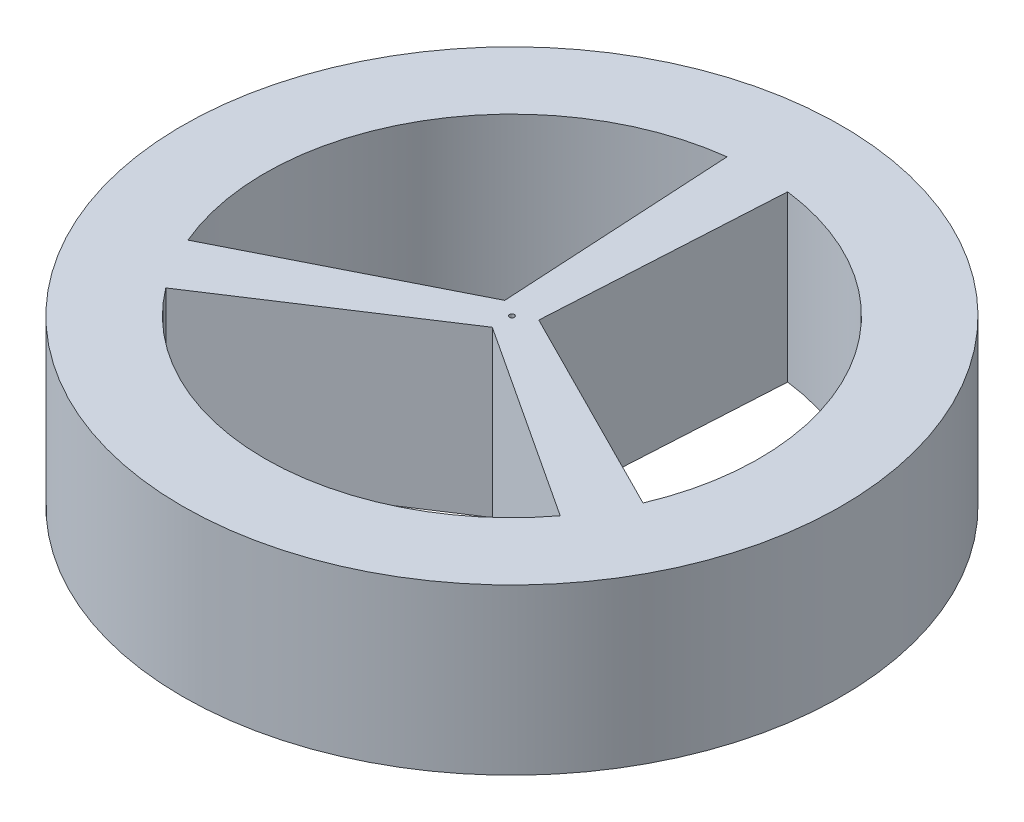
ISO-10303-21;
HEADER;
FILE_DESCRIPTION(('STEP AP214'),'2;1');
FILE_NAME('part.step','',(''),(''),'','','');
FILE_SCHEMA(('AUTOMOTIVE_DESIGN { 1 0 10303 214 1 1 1 1 }'));
ENDSEC;
DATA;
#1=APPLICATION_CONTEXT('core data for automotive mechanical design processes');
#2=APPLICATION_PROTOCOL_DEFINITION('international standard','automotive_design',2000,#1);
#3=PRODUCT_CONTEXT('',#1,'mechanical');
#4=PRODUCT('Part','Part','',(#3));
#5=PRODUCT_RELATED_PRODUCT_CATEGORY('part','',(#4));
#6=PRODUCT_DEFINITION_FORMATION('','',#4);
#7=PRODUCT_DEFINITION_CONTEXT('part definition',#1,'design');
#8=PRODUCT_DEFINITION('design','',#6,#7);
#9=PRODUCT_DEFINITION_SHAPE('','',#8);
#10=(LENGTH_UNIT() NAMED_UNIT(*) SI_UNIT(.MILLI.,.METRE.));
#11=(NAMED_UNIT(*) PLANE_ANGLE_UNIT() SI_UNIT($,.RADIAN.));
#12=(NAMED_UNIT(*) SI_UNIT($,.STERADIAN.) SOLID_ANGLE_UNIT());
#13=UNCERTAINTY_MEASURE_WITH_UNIT(LENGTH_MEASURE(1.E-05),#10,'distance_accuracy_value','');
#14=(GEOMETRIC_REPRESENTATION_CONTEXT(3) GLOBAL_UNCERTAINTY_ASSIGNED_CONTEXT((#13)) GLOBAL_UNIT_ASSIGNED_CONTEXT((#10,
#11,#12)) REPRESENTATION_CONTEXT('',''));
#15=CARTESIAN_POINT('',(0.,0.,0.));
#16=DIRECTION('',(0.,0.,1.));
#17=DIRECTION('',(1.,0.,0.));
#18=AXIS2_PLACEMENT_3D('',#15,#16,#17);
#19=CARTESIAN_POINT('',(0.996804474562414,10.,0.0564385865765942));
#20=DIRECTION('',(0.998400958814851,0.,0.0565289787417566));
#21=DIRECTION('',(0.0565289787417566,0.,-0.998400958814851));
#22=AXIS2_PLACEMENT_3D('',#19,#20,#21);
#23=PLANE('',#22);
#24=DIRECTION('',(-0.0565289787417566,0.,0.998400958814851));
#25=VECTOR('',#24,1.);
#26=CARTESIAN_POINT('',(0.996804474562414,0.,0.0564385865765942));
#27=LINE('',#26,#25);
#28=CARTESIAN_POINT('',(1.84285879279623,0.,-14.8863652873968));
#29=VERTEX_POINT('',#28);
#30=CARTESIAN_POINT('',(1.03377199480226,0.,-0.596472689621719));
#31=VERTEX_POINT('',#30);
#32=EDGE_CURVE('E123',#29,#31,#27,.T.);
#33=ORIENTED_EDGE('',*,*,#32,.F.);
#34=DIRECTION('',(0.,-1.,0.));
#35=VECTOR('',#34,1.);
#36=CARTESIAN_POINT('',(1.84285879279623,10.,-14.8863652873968));
#37=LINE('',#36,#35);
#38=CARTESIAN_POINT('',(1.84285879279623,10.,-14.8863652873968));
#39=VERTEX_POINT('',#38);
#40=EDGE_CURVE('E11',#39,#29,#37,.T.);
#41=ORIENTED_EDGE('',*,*,#40,.F.);
#42=DIRECTION('',(-0.0565289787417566,0.,0.998400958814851));
#43=VECTOR('',#42,1.);
#44=CARTESIAN_POINT('',(0.996804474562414,10.,0.0564385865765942));
#45=LINE('',#44,#43);
#46=CARTESIAN_POINT('',(1.03377199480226,10.,-0.596472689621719));
#47=VERTEX_POINT('',#46);
#48=EDGE_CURVE('E121',#39,#47,#45,.T.);
#49=ORIENTED_EDGE('',*,*,#48,.T.);
#50=DIRECTION('',(0.,-1.,0.));
#51=VECTOR('',#50,1.);
#52=CARTESIAN_POINT('',(1.03377199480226,10.,-0.596472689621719));
#53=LINE('',#52,#51);
#54=EDGE_CURVE('E98',#47,#31,#53,.T.);
#55=ORIENTED_EDGE('',*,*,#54,.T.);
#56=EDGE_LOOP('',(#33,#41,#49,#55));
#57=FACE_BOUND('',#56,.T.);
#58=ADVANCED_FACE('F43',(#57),#23,.T.);
#59=CARTESIAN_POINT('',(0.,10.,0.));
#60=DIRECTION('',(0.,-1.,0.));
#61=DIRECTION('',(0.,0.,-1.));
#62=AXIS2_PLACEMENT_3D('',#59,#60,#61);
#63=CYLINDRICAL_SURFACE('',#62,15.);
#64=CARTESIAN_POINT('',(0.,0.,0.));
#65=DIRECTION('',(0.,1.,0.));
#66=DIRECTION('',(0.,0.,1.));
#67=AXIS2_PLACEMENT_3D('',#64,#65,#66);
#68=CIRCLE('',#67,15.);
#69=CARTESIAN_POINT('',(13.8099212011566,0.,5.85543136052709));
#70=VERTEX_POINT('',#69);
#71=EDGE_CURVE('E152',#70,#29,#68,.T.);
#72=ORIENTED_EDGE('',*,*,#71,.F.);
#73=DIRECTION('',(0.,-1.,0.));
#74=VECTOR('',#73,1.);
#75=CARTESIAN_POINT('',(13.8099212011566,10.,5.85543136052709));
#76=LINE('',#75,#74);
#77=CARTESIAN_POINT('',(13.8099212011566,10.,5.85543136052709));
#78=VERTEX_POINT('',#77);
#79=EDGE_CURVE('E53',#78,#70,#76,.T.);
#80=ORIENTED_EDGE('',*,*,#79,.F.);
#81=CARTESIAN_POINT('',(0.,10.,0.));
#82=DIRECTION('',(0.,1.,0.));
#83=DIRECTION('',(0.,0.,1.));
#84=AXIS2_PLACEMENT_3D('',#81,#82,#83);
#85=CIRCLE('',#84,15.);
#86=EDGE_CURVE('E130',#78,#39,#85,.T.);
#87=ORIENTED_EDGE('',*,*,#86,.T.);
#88=ORIENTED_EDGE('',*,*,#40,.T.);
#89=EDGE_LOOP('',(#72,#80,#87,#88));
#90=FACE_BOUND('',#89,.T.);
#91=ADVANCED_FACE('F133',(#90),#63,.F.);
#92=CARTESIAN_POINT('',(-1.83400829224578,0.,-14.8874582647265));
#93=VERTEX_POINT('',#92);
#94=CARTESIAN_POINT('',(-13.8133999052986,0.,5.84722011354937));
#95=VERTEX_POINT('',#94);
#96=EDGE_CURVE('E184',#93,#95,#68,.T.);
#97=ORIENTED_EDGE('',*,*,#96,.F.);
#98=DIRECTION('',(0.,-1.,0.));
#99=VECTOR('',#98,1.);
#100=CARTESIAN_POINT('',(-1.83400829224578,10.,-14.8874582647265));
#101=LINE('',#100,#99);
#102=CARTESIAN_POINT('',(-1.83400829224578,10.,-14.8874582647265));
#103=VERTEX_POINT('',#102);
#104=EDGE_CURVE('E157',#103,#93,#101,.T.);
#105=ORIENTED_EDGE('',*,*,#104,.F.);
#106=CARTESIAN_POINT('',(-13.8133999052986,10.,5.84722011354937));
#107=VERTEX_POINT('',#106);
#108=EDGE_CURVE('E135',#103,#107,#85,.T.);
#109=ORIENTED_EDGE('',*,*,#108,.T.);
#110=DIRECTION('',(0.,-1.,0.));
#111=VECTOR('',#110,1.);
#112=CARTESIAN_POINT('',(-13.8133999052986,10.,5.84722011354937));
#113=LINE('',#112,#111);
#114=EDGE_CURVE('E159',#107,#95,#113,.T.);
#115=ORIENTED_EDGE('',*,*,#114,.T.);
#116=EDGE_LOOP('',(#97,#105,#109,#115));
#117=FACE_BOUND('',#116,.T.);
#118=ADVANCED_FACE('F220',(#117),#63,.F.);
#119=CARTESIAN_POINT('',(-0.996871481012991,10.,0.055845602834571));
#120=DIRECTION('',(0.998434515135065,0.,-0.0559331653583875));
#121=DIRECTION('',(-0.0559331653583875,0.,-0.998434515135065));
#122=AXIS2_PLACEMENT_3D('',#119,#120,#121);
#123=PLANE('',#122);
#124=DIRECTION('',(0.0559331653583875,0.,0.998434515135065));
#125=VECTOR('',#124,1.);
#126=CARTESIAN_POINT('',(-0.996871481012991,0.,0.055845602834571));
#127=LINE('',#126,#125);
#128=CARTESIAN_POINT('',(-1.03344649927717,0.,-0.597036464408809));
#129=VERTEX_POINT('',#128);
#130=EDGE_CURVE('E187',#93,#129,#127,.T.);
#131=ORIENTED_EDGE('',*,*,#130,.T.);
#132=DIRECTION('',(0.,-1.,0.));
#133=VECTOR('',#132,1.);
#134=CARTESIAN_POINT('',(-1.03344649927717,10.,-0.597036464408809));
#135=LINE('',#134,#133);
#136=CARTESIAN_POINT('',(-1.03344649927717,10.,-0.597036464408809));
#137=VERTEX_POINT('',#136);
#138=EDGE_CURVE('E161',#137,#129,#135,.T.);
#139=ORIENTED_EDGE('',*,*,#138,.F.);
#140=DIRECTION('',(0.0559331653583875,0.,0.998434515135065));
#141=VECTOR('',#140,1.);
#142=CARTESIAN_POINT('',(-0.996871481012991,10.,0.055845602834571));
#143=LINE('',#142,#141);
#144=EDGE_CURVE('E141',#103,#137,#143,.T.);
#145=ORIENTED_EDGE('',*,*,#144,.F.);
#146=ORIENTED_EDGE('',*,*,#104,.T.);
#147=EDGE_LOOP('',(#131,#139,#145,#146));
#148=FACE_BOUND('',#147,.T.);
#149=ADVANCED_FACE('F226',(#148),#123,.F.);
#150=CARTESIAN_POINT('',(-11.9759129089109,0.,9.03202690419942));
#151=VERTEX_POINT('',#150);
#152=CARTESIAN_POINT('',(11.9705411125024,0.,9.03914517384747));
#153=VERTEX_POINT('',#152);
#154=EDGE_CURVE('E179',#151,#153,#68,.T.);
#155=ORIENTED_EDGE('',*,*,#154,.F.);
#156=DIRECTION('',(0.,-1.,0.));
#157=VECTOR('',#156,1.);
#158=CARTESIAN_POINT('',(-11.9759129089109,10.,9.03202690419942));
#159=LINE('',#158,#157);
#160=CARTESIAN_POINT('',(-11.9759129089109,10.,9.03202690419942));
#161=VERTEX_POINT('',#160);
#162=EDGE_CURVE('E47',#161,#151,#159,.T.);
#163=ORIENTED_EDGE('',*,*,#162,.F.);
#164=CARTESIAN_POINT('',(11.9705411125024,10.,9.03914517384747));
#165=VERTEX_POINT('',#164);
#166=EDGE_CURVE('E136',#161,#165,#85,.T.);
#167=ORIENTED_EDGE('',*,*,#166,.T.);
#168=DIRECTION('',(0.,-1.,0.));
#169=VECTOR('',#168,1.);
#170=CARTESIAN_POINT('',(11.9705411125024,10.,9.03914517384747));
#171=LINE('',#170,#169);
#172=EDGE_CURVE('E164',#165,#153,#171,.T.);
#173=ORIENTED_EDGE('',*,*,#172,.T.);
#174=EDGE_LOOP('',(#155,#163,#167,#173));
#175=FACE_BOUND('',#174,.T.);
#176=ADVANCED_FACE('F182',(#175),#63,.F.);
#177=CARTESIAN_POINT('',(0.54679945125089,10.,0.835393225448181));
#178=DIRECTION('',(-0.547656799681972,0.,-0.836703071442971));
#179=DIRECTION('',(-0.836703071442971,0.,0.547656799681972));
#180=AXIS2_PLACEMENT_3D('',#177,#178,#179);
#181=PLANE('',#180);
#182=DIRECTION('',(0.836703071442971,0.,-0.547656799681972));
#183=VECTOR('',#182,1.);
#184=CARTESIAN_POINT('',(0.54679945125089,0.,0.835393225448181));
#185=LINE('',#184,#183);
#186=CARTESIAN_POINT('',(-0.000325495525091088,0.,1.19350915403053));
#187=VERTEX_POINT('',#186);
#188=EDGE_CURVE('E173',#151,#187,#185,.T.);
#189=ORIENTED_EDGE('',*,*,#188,.T.);
#190=DIRECTION('',(0.,-1.,0.));
#191=VECTOR('',#190,1.);
#192=CARTESIAN_POINT('',(-0.000325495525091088,10.,1.19350915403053));
#193=LINE('',#192,#191);
#194=CARTESIAN_POINT('',(-0.000325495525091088,10.,1.19350915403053));
#195=VERTEX_POINT('',#194);
#196=EDGE_CURVE('E165',#195,#187,#193,.T.);
#197=ORIENTED_EDGE('',*,*,#196,.F.);
#198=DIRECTION('',(0.836703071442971,0.,-0.547656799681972));
#199=VECTOR('',#198,1.);
#200=CARTESIAN_POINT('',(0.54679945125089,10.,0.835393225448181));
#201=LINE('',#200,#199);
#202=EDGE_CURVE('E143',#161,#195,#201,.T.);
#203=ORIENTED_EDGE('',*,*,#202,.F.);
#204=ORIENTED_EDGE('',*,*,#162,.T.);
#205=EDGE_LOOP('',(#189,#197,#203,#204));
#206=FACE_BOUND('',#205,.T.);
#207=ADVANCED_FACE('F45',(#206),#181,.F.);
#208=CARTESIAN_POINT('',(0.4500720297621,10.,-0.891238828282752));
#209=DIRECTION('',(-0.450777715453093,0.,0.892636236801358));
#210=DIRECTION('',(0.892636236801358,0.,0.450777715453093));
#211=AXIS2_PLACEMENT_3D('',#208,#209,#210);
#212=PLANE('',#211);
#213=DIRECTION('',(-0.892636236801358,0.,-0.450777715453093));
#214=VECTOR('',#213,1.);
#215=CARTESIAN_POINT('',(0.4500720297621,0.,-0.891238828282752));
#216=LINE('',#215,#214);
#217=EDGE_CURVE('E148',#70,#31,#216,.T.);
#218=ORIENTED_EDGE('',*,*,#217,.T.);
#219=ORIENTED_EDGE('',*,*,#54,.F.);
#220=DIRECTION('',(-0.892636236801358,0.,-0.450777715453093));
#221=VECTOR('',#220,1.);
#222=CARTESIAN_POINT('',(0.4500720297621,10.,-0.891238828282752));
#223=LINE('',#222,#221);
#224=EDGE_CURVE('E62',#78,#47,#223,.T.);
#225=ORIENTED_EDGE('',*,*,#224,.F.);
#226=ORIENTED_EDGE('',*,*,#79,.T.);
#227=EDGE_LOOP('',(#218,#219,#225,#226));
#228=FACE_BOUND('',#227,.T.);
#229=ADVANCED_FACE('F202',(#228),#212,.F.);
#230=CARTESIAN_POINT('',(0.,10.,0.));
#231=DIRECTION('',(0.,-1.,0.));
#232=DIRECTION('',(0.,0.,-1.));
#233=AXIS2_PLACEMENT_3D('',#230,#231,#232);
#234=CYLINDRICAL_SURFACE('',#233,0.15);
#235=CARTESIAN_POINT('',(0.,10.,0.));
#236=DIRECTION('',(0.,1.,0.));
#237=DIRECTION('',(0.,0.,1.));
#238=AXIS2_PLACEMENT_3D('',#235,#236,#237);
#239=CIRCLE('',#238,0.15);
#240=CARTESIAN_POINT('',(0.,10.,0.15));
#241=VERTEX_POINT('',#240);
#242=EDGE_CURVE('E131',#241,#241,#239,.T.);
#243=ORIENTED_EDGE('',*,*,#242,.T.);
#244=EDGE_LOOP('',(#243));
#245=FACE_BOUND('',#244,.T.);
#246=CARTESIAN_POINT('',(0.,0.,0.));
#247=DIRECTION('',(0.,1.,0.));
#248=DIRECTION('',(0.,0.,1.));
#249=AXIS2_PLACEMENT_3D('',#246,#247,#248);
#250=CIRCLE('',#249,0.15);
#251=CARTESIAN_POINT('',(0.,0.,0.15));
#252=VERTEX_POINT('',#251);
#253=EDGE_CURVE('E198',#252,#252,#250,.T.);
#254=ORIENTED_EDGE('',*,*,#253,.F.);
#255=EDGE_LOOP('',(#254));
#256=FACE_BOUND('',#255,.T.);
#257=ADVANCED_FACE('F204',(#245,#256),#234,.F.);
#258=CARTESIAN_POINT('',(-0.449524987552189,10.,-0.891477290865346));
#259=DIRECTION('',(-0.450244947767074,0.,-0.89290508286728));
#260=DIRECTION('',(-0.89290508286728,0.,0.450244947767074));
#261=AXIS2_PLACEMENT_3D('',#258,#259,#260);
#262=PLANE('',#261);
#263=DIRECTION('',(0.89290508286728,0.,-0.450244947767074));
#264=VECTOR('',#263,1.);
#265=CARTESIAN_POINT('',(-0.449524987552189,0.,-0.891477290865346));
#266=LINE('',#265,#264);
#267=EDGE_CURVE('E193',#95,#129,#266,.T.);
#268=ORIENTED_EDGE('',*,*,#267,.F.);
#269=ORIENTED_EDGE('',*,*,#114,.F.);
#270=DIRECTION('',(0.89290508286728,0.,-0.450244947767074));
#271=VECTOR('',#270,1.);
#272=CARTESIAN_POINT('',(-0.449524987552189,10.,-0.891477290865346));
#273=LINE('',#272,#271);
#274=EDGE_CURVE('E239',#107,#137,#273,.T.);
#275=ORIENTED_EDGE('',*,*,#274,.T.);
#276=ORIENTED_EDGE('',*,*,#138,.T.);
#277=EDGE_LOOP('',(#268,#269,#275,#276));
#278=FACE_BOUND('',#277,.T.);
#279=ADVANCED_FACE('F210',(#278),#262,.T.);
#280=CARTESIAN_POINT('',(-0.547279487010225,10.,0.835038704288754));
#281=DIRECTION('',(-0.548156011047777,0.,0.836376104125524));
#282=DIRECTION('',(0.836376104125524,0.,0.548156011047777));
#283=AXIS2_PLACEMENT_3D('',#280,#281,#282);
#284=PLANE('',#283);
#285=DIRECTION('',(-0.836376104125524,0.,-0.548156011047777));
#286=VECTOR('',#285,1.);
#287=CARTESIAN_POINT('',(-0.547279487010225,0.,0.835038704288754));
#288=LINE('',#287,#286);
#289=EDGE_CURVE('E180',#153,#187,#288,.T.);
#290=ORIENTED_EDGE('',*,*,#289,.F.);
#291=ORIENTED_EDGE('',*,*,#172,.F.);
#292=DIRECTION('',(-0.836376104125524,0.,-0.548156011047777));
#293=VECTOR('',#292,1.);
#294=CARTESIAN_POINT('',(-0.547279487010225,10.,0.835038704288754));
#295=LINE('',#294,#293);
#296=EDGE_CURVE('E142',#165,#195,#295,.T.);
#297=ORIENTED_EDGE('',*,*,#296,.T.);
#298=ORIENTED_EDGE('',*,*,#196,.T.);
#299=EDGE_LOOP('',(#290,#291,#297,#298));
#300=FACE_BOUND('',#299,.T.);
#301=ADVANCED_FACE('F224',(#300),#284,.T.);
#302=CARTESIAN_POINT('',(0.,10.,0.));
#303=DIRECTION('',(0.,-1.,0.));
#304=DIRECTION('',(0.,0.,-1.));
#305=AXIS2_PLACEMENT_3D('',#302,#303,#304);
#306=CYLINDRICAL_SURFACE('',#305,20.);
#307=CARTESIAN_POINT('',(0.,10.,0.));
#308=DIRECTION('',(0.,1.,0.));
#309=DIRECTION('',(0.,0.,1.));
#310=AXIS2_PLACEMENT_3D('',#307,#308,#309);
#311=CIRCLE('',#310,20.);
#312=CARTESIAN_POINT('',(0.,10.,20.));
#313=VERTEX_POINT('',#312);
#314=EDGE_CURVE('E137',#313,#313,#311,.T.);
#315=ORIENTED_EDGE('',*,*,#314,.F.);
#316=EDGE_LOOP('',(#315));
#317=FACE_BOUND('',#316,.T.);
#318=CARTESIAN_POINT('',(0.,0.,0.));
#319=DIRECTION('',(0.,1.,0.));
#320=DIRECTION('',(0.,0.,1.));
#321=AXIS2_PLACEMENT_3D('',#318,#319,#320);
#322=CIRCLE('',#321,20.);
#323=CARTESIAN_POINT('',(0.,0.,20.));
#324=VERTEX_POINT('',#323);
#325=EDGE_CURVE('E144',#324,#324,#322,.T.);
#326=ORIENTED_EDGE('',*,*,#325,.T.);
#327=EDGE_LOOP('',(#326));
#328=FACE_BOUND('',#327,.T.);
#329=ADVANCED_FACE('F230',(#317,#328),#306,.T.);
#330=CARTESIAN_POINT('',(0.,10.,0.));
#331=DIRECTION('',(0.,1.,0.));
#332=DIRECTION('',(0.,0.,1.));
#333=AXIS2_PLACEMENT_3D('',#330,#331,#332);
#334=PLANE('',#333);
#335=ORIENTED_EDGE('',*,*,#166,.F.);
#336=ORIENTED_EDGE('',*,*,#202,.T.);
#337=ORIENTED_EDGE('',*,*,#296,.F.);
#338=EDGE_LOOP('',(#335,#336,#337));
#339=FACE_BOUND('',#338,.T.);
#340=ORIENTED_EDGE('',*,*,#108,.F.);
#341=ORIENTED_EDGE('',*,*,#144,.T.);
#342=ORIENTED_EDGE('',*,*,#274,.F.);
#343=EDGE_LOOP('',(#340,#341,#342));
#344=FACE_BOUND('',#343,.T.);
#345=ORIENTED_EDGE('',*,*,#242,.F.);
#346=EDGE_LOOP('',(#345));
#347=FACE_BOUND('',#346,.T.);
#348=ORIENTED_EDGE('',*,*,#48,.F.);
#349=ORIENTED_EDGE('',*,*,#86,.F.);
#350=ORIENTED_EDGE('',*,*,#224,.T.);
#351=EDGE_LOOP('',(#348,#349,#350));
#352=FACE_BOUND('',#351,.T.);
#353=ORIENTED_EDGE('',*,*,#314,.T.);
#354=EDGE_LOOP('',(#353));
#355=FACE_BOUND('',#354,.T.);
#356=ADVANCED_FACE('F128',(#339,#344,#347,#352,#355),#334,.T.);
#357=CARTESIAN_POINT('',(0.,0.,0.));
#358=DIRECTION('',(0.,1.,0.));
#359=DIRECTION('',(0.,0.,1.));
#360=AXIS2_PLACEMENT_3D('',#357,#358,#359);
#361=PLANE('',#360);
#362=ORIENTED_EDGE('',*,*,#154,.T.);
#363=ORIENTED_EDGE('',*,*,#289,.T.);
#364=ORIENTED_EDGE('',*,*,#188,.F.);
#365=EDGE_LOOP('',(#362,#363,#364));
#366=FACE_BOUND('',#365,.T.);
#367=ORIENTED_EDGE('',*,*,#96,.T.);
#368=ORIENTED_EDGE('',*,*,#267,.T.);
#369=ORIENTED_EDGE('',*,*,#130,.F.);
#370=EDGE_LOOP('',(#367,#368,#369));
#371=FACE_BOUND('',#370,.T.);
#372=ORIENTED_EDGE('',*,*,#253,.T.);
#373=EDGE_LOOP('',(#372));
#374=FACE_BOUND('',#373,.T.);
#375=ORIENTED_EDGE('',*,*,#32,.T.);
#376=ORIENTED_EDGE('',*,*,#217,.F.);
#377=ORIENTED_EDGE('',*,*,#71,.T.);
#378=EDGE_LOOP('',(#375,#376,#377));
#379=FACE_BOUND('',#378,.T.);
#380=ORIENTED_EDGE('',*,*,#325,.F.);
#381=EDGE_LOOP('',(#380));
#382=FACE_BOUND('',#381,.T.);
#383=ADVANCED_FACE('F177',(#366,#371,#374,#379,#382),#361,.F.);
#384=CLOSED_SHELL('',(#58,#91,#118,#149,#176,#207,#229,#257,#279,#301,#329,#356,#383));
#385=MANIFOLD_SOLID_BREP('B2',#384);
#386=ADVANCED_BREP_SHAPE_REPRESENTATION('',(#18,#385),#14);
#387=SHAPE_DEFINITION_REPRESENTATION(#9,#386);
ENDSEC;
END-ISO-10303-21;
